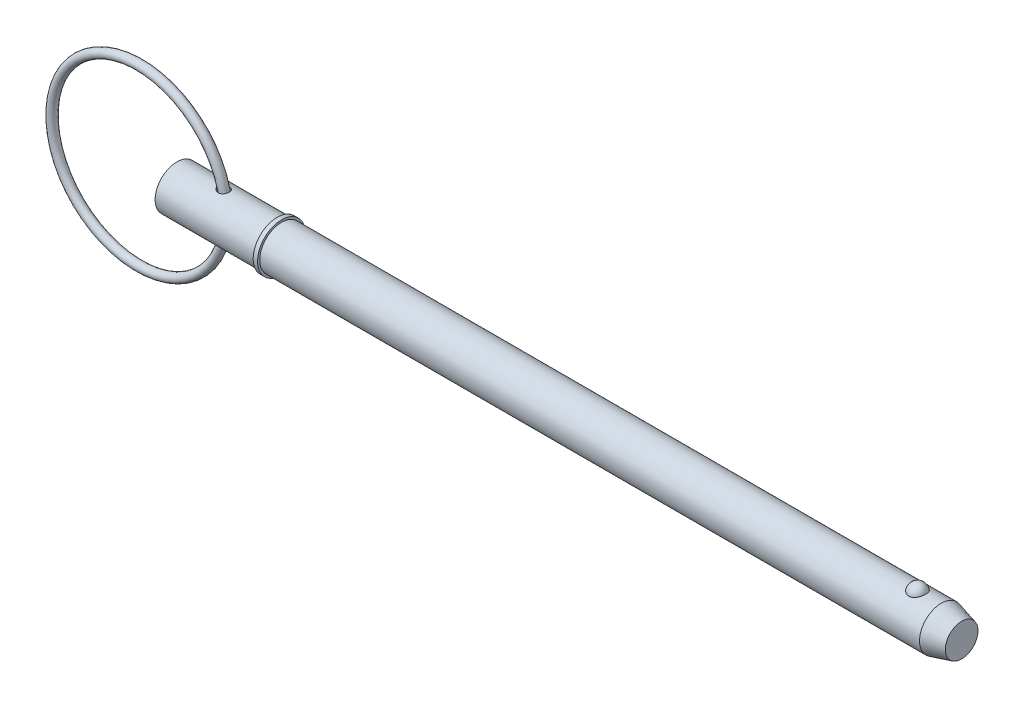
ISO-10303-21;
HEADER;
FILE_DESCRIPTION(('STEP AP214'),'2;1');
FILE_NAME('part.step','',(''),(''),'','','');
FILE_SCHEMA(('AUTOMOTIVE_DESIGN { 1 0 10303 214 1 1 1 1 }'));
ENDSEC;
DATA;
#1=APPLICATION_CONTEXT('core data for automotive mechanical design processes');
#2=APPLICATION_PROTOCOL_DEFINITION('international standard','automotive_design',2000,#1);
#3=PRODUCT_CONTEXT('',#1,'mechanical');
#4=PRODUCT('Part','Part','',(#3));
#5=PRODUCT_RELATED_PRODUCT_CATEGORY('part','',(#4));
#6=PRODUCT_DEFINITION_FORMATION('','',#4);
#7=PRODUCT_DEFINITION_CONTEXT('part definition',#1,'design');
#8=PRODUCT_DEFINITION('design','',#6,#7);
#9=PRODUCT_DEFINITION_SHAPE('','',#8);
#10=(LENGTH_UNIT() NAMED_UNIT(*) SI_UNIT(.MILLI.,.METRE.));
#11=(NAMED_UNIT(*) PLANE_ANGLE_UNIT() SI_UNIT($,.RADIAN.));
#12=(NAMED_UNIT(*) SI_UNIT($,.STERADIAN.) SOLID_ANGLE_UNIT());
#13=UNCERTAINTY_MEASURE_WITH_UNIT(LENGTH_MEASURE(1.E-05),#10,'distance_accuracy_value','');
#14=(GEOMETRIC_REPRESENTATION_CONTEXT(3) GLOBAL_UNCERTAINTY_ASSIGNED_CONTEXT((#13)) GLOBAL_UNIT_ASSIGNED_CONTEXT((#10,
#11,#12)) REPRESENTATION_CONTEXT('',''));
#15=CARTESIAN_POINT('',(0.,0.,0.));
#16=DIRECTION('',(0.,0.,1.));
#17=DIRECTION('',(1.,0.,0.));
#18=AXIS2_PLACEMENT_3D('',#15,#16,#17);
#19=CARTESIAN_POINT('',(-6.86864682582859,0.,0.));
#20=DIRECTION('',(0.,0.,1.));
#21=DIRECTION('',(1.,0.,0.));
#22=AXIS2_PLACEMENT_3D('',#19,#20,#21);
#23=TOROIDAL_SURFACE('',#22,15.875,0.794);
#24=CARTESIAN_POINT('',(9.80035317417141,0.,0.));
#25=VERTEX_POINT('',#24);
#26=VERTEX_LOOP('',#25);
#27=FACE_BOUND('',#26,.T.);
#28=ADVANCED_FACE('P0_F12',(#27),#23,.T.);
#29=CLOSED_SHELL('',(#28));
#30=MANIFOLD_SOLID_BREP('P0_B1',#29);
#31=CARTESIAN_POINT('',(0.,0.,0.));
#32=DIRECTION('',(1.,0.,0.));
#33=DIRECTION('',(0.,0.,-1.));
#34=AXIS2_PLACEMENT_3D('',#31,#32,#33);
#35=CYLINDRICAL_SURFACE('',#34,3.97);
#36=CARTESIAN_POINT('',(7.55504033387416,3.95240335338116,-0.373373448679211));
#37=CARTESIAN_POINT('',(7.57857626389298,3.94742764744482,-0.426034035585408));
#38=CARTESIAN_POINT('',(7.60690043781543,3.94158882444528,-0.476521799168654));
#39=CARTESIAN_POINT('',(7.67175252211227,3.92889627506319,-0.571840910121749));
#40=CARTESIAN_POINT('',(7.70829717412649,3.92204048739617,-0.616660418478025));
#41=CARTESIAN_POINT('',(7.7880127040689,3.90811378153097,-0.699502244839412));
#42=CARTESIAN_POINT('',(7.83115323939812,3.90104396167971,-0.737554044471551));
#43=CARTESIAN_POINT('',(7.92290500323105,3.88739302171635,-0.806417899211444));
#44=CARTESIAN_POINT('',(7.97151503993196,3.88081179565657,-0.837231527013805));
#45=CARTESIAN_POINT('',(8.07649084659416,3.86840671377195,-0.89285990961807));
#46=CARTESIAN_POINT('',(8.13315921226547,3.86266475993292,-0.917124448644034));
#47=CARTESIAN_POINT('',(8.249903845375,3.85323449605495,-0.95597423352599));
#48=CARTESIAN_POINT('',(8.30998046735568,3.84954640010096,-0.970558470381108));
#49=CARTESIAN_POINT('',(8.43159099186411,3.84477321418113,-0.989300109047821));
#50=CARTESIAN_POINT('',(8.49311729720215,3.84367671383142,-0.993503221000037));
#51=CARTESIAN_POINT('',(8.61594280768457,3.84429915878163,-0.991094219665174));
#52=CARTESIAN_POINT('',(8.67724211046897,3.84601670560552,-0.984487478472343));
#53=CARTESIAN_POINT('',(8.79355089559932,3.85191689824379,-0.961127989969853));
#54=CARTESIAN_POINT('',(8.84870898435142,3.85593011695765,-0.945070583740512));
#55=CARTESIAN_POINT('',(8.95525145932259,3.86583609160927,-0.903692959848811));
#56=CARTESIAN_POINT('',(9.00663668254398,3.87172842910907,-0.878374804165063));
#57=CARTESIAN_POINT('',(9.101933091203,3.88440641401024,-0.820440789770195));
#58=CARTESIAN_POINT('',(9.14607052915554,3.89114280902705,-0.788185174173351));
#59=CARTESIAN_POINT('',(9.22823149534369,3.90493885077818,-0.71671042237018));
#60=CARTESIAN_POINT('',(9.26625504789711,3.91199849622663,-0.677491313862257));
#61=CARTESIAN_POINT('',(9.33526828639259,3.92567450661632,-0.59313132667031));
#62=CARTESIAN_POINT('',(9.36624800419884,3.93229023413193,-0.547982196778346));
#63=CARTESIAN_POINT('',(9.42036305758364,3.94435299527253,-0.453062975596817));
#64=CARTESIAN_POINT('',(9.44349799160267,3.94979996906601,-0.403292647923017));
#65=CARTESIAN_POINT('',(9.48161154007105,3.95900091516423,-0.299892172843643));
#66=CARTESIAN_POINT('',(9.49648966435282,3.96273393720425,-0.246223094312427));
#67=CARTESIAN_POINT('',(9.51731386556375,3.96800895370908,-0.137074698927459));
#68=CARTESIAN_POINT('',(9.52325977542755,3.9695509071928,-0.0815953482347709));
#69=CARTESIAN_POINT('',(9.52608552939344,3.97028010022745,0.0297918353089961));
#70=CARTESIAN_POINT('',(9.52293563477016,3.96945961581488,0.0857004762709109));
#71=CARTESIAN_POINT('',(9.5075790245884,3.96553529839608,0.196178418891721));
#72=CARTESIAN_POINT('',(9.49537214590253,3.96243142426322,0.25074769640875));
#73=CARTESIAN_POINT('',(9.46218733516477,3.95427513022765,0.357000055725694));
#74=CARTESIAN_POINT('',(9.44120904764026,3.94922263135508,0.40868302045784));
#75=CARTESIAN_POINT('',(9.39097869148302,3.93771960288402,0.507691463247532));
#76=CARTESIAN_POINT('',(9.36172655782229,3.93126906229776,0.555016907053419));
#77=CARTESIAN_POINT('',(9.29572260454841,3.9176964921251,0.643874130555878));
#78=CARTESIAN_POINT('',(9.25898413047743,3.91057566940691,0.685416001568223));
#79=CARTESIAN_POINT('',(9.1789232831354,3.89645576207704,0.761601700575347));
#80=CARTESIAN_POINT('',(9.13560164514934,3.88945666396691,0.79624629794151));
#81=CARTESIAN_POINT('',(9.04406003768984,3.87645097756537,0.857319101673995));
#82=CARTESIAN_POINT('',(8.99589768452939,3.87043453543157,0.883831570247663));
#83=CARTESIAN_POINT('',(8.89567287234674,3.85997577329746,0.928447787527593));
#84=CARTESIAN_POINT('',(8.84361081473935,3.85553329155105,0.946552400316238));
#85=CARTESIAN_POINT('',(8.73746664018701,3.84871527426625,0.973904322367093));
#86=CARTESIAN_POINT('',(8.68340054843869,3.84632597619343,0.983210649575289));
#87=CARTESIAN_POINT('',(8.57443237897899,3.84376823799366,0.993162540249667));
#88=CARTESIAN_POINT('',(8.51953018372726,3.84360011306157,0.993806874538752));
#89=CARTESIAN_POINT('',(8.40868901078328,3.84546046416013,0.986583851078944));
#90=CARTESIAN_POINT('',(8.35276804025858,3.84755469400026,0.97846170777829));
#91=CARTESIAN_POINT('',(8.24293801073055,3.85374731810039,0.953777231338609));
#92=CARTESIAN_POINT('',(8.18902962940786,3.85784638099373,0.937212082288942));
#93=CARTESIAN_POINT('',(8.08103474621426,3.86789936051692,0.894850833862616));
#94=CARTESIAN_POINT('',(8.02716623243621,3.87395687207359,0.868522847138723));
#95=CARTESIAN_POINT('',(7.92444974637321,3.88711632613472,0.807586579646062));
#96=CARTESIAN_POINT('',(7.87560399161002,3.89421872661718,0.7729746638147));
#97=CARTESIAN_POINT('',(7.7825771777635,3.90895350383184,0.694712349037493));
#98=CARTESIAN_POINT('',(7.73864194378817,3.916595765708,0.650769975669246));
#99=CARTESIAN_POINT('',(7.65930793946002,3.93121788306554,0.555638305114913));
#100=CARTESIAN_POINT('',(7.62390591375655,3.93819799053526,0.504451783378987));
#101=CARTESIAN_POINT('',(7.56512704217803,3.95020492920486,0.399268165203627));
#102=CARTESIAN_POINT('',(7.54117152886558,3.95532161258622,0.345606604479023));
#103=CARTESIAN_POINT('',(7.5037545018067,3.96345177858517,0.234589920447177));
#104=CARTESIAN_POINT('',(7.49028363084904,3.96646713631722,0.177238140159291));
#105=CARTESIAN_POINT('',(7.4756155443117,3.96976030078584,0.0675802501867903));
#106=CARTESIAN_POINT('',(7.47319553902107,3.97031070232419,0.0154431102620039));
#107=CARTESIAN_POINT('',(7.47743162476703,3.96935406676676,-0.0884045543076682));
#108=CARTESIAN_POINT('',(7.48407724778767,3.96784940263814,-0.14011550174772));
#109=CARTESIAN_POINT('',(7.50184406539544,3.96390208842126,-0.222210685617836));
#110=CARTESIAN_POINT('',(7.51030342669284,3.96203347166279,-0.253229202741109));
#111=CARTESIAN_POINT('',(7.53036279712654,3.95766645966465,-0.314179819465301));
#112=CARTESIAN_POINT('',(7.5419623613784,3.9551681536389,-0.344112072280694));
#113=CARTESIAN_POINT('',(7.55504033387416,3.95240335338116,-0.373373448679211));
#114=B_SPLINE_CURVE_WITH_KNOTS('',3,(#36,#37,#38,#39,#40,#41,#42,#43,#44,#45,#46,#47,#48,#49,
#50,#51,#52,#53,#54,#55,#56,#57,#58,#59,#60,#61,#62,#63,#64,#65,#66,#67,#68,#69,#70,#71,#72,#73,
#74,#75,#76,#77,#78,#79,#80,#81,#82,#83,#84,#85,#86,#87,#88,#89,#90,#91,#92,#93,#94,#95,#96,#97,
#98,#99,#100,#101,#102,#103,#104,#105,#106,#107,#108,#109,#110,#111,#112,#113),.UNSPECIFIED.,
.T.,.F.,(4,2,2,2,2,2,2,2,2,2,2,2,2,2,2,2,2,2,2,2,2,2,2,2,2,2,2,2,2,2,2,2,2,2,2,2,2,2,4),(0.,
0.173554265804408,0.347465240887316,0.520599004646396,0.693695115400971,0.878558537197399,
1.0634412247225,1.24750837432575,1.43148407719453,1.60336872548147,1.77521512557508,
1.93967886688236,2.10414195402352,2.26883635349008,2.43353918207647,2.60020488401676,
2.76687370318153,2.93408806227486,3.10130543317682,3.26852958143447,3.43575504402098,
3.60268496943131,3.76959626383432,3.93471461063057,4.0998159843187,4.26380184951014,
4.42781098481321,4.5967184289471,4.76568224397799,4.94567321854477,5.12574332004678,
5.31261375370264,5.49941278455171,5.67537040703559,5.85117081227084,6.00695555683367,
6.16256057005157,6.25901137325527,6.35544851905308),.UNSPECIFIED.);
#115=CARTESIAN_POINT('',(7.55504033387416,3.95240335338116,-0.373373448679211));
#116=VERTEX_POINT('',#115);
#117=EDGE_CURVE('P1_E42',#116,#116,#114,.T.);
#118=ORIENTED_EDGE('',*,*,#117,.T.);
#119=EDGE_LOOP('',(#118));
#120=FACE_BOUND('',#119,.T.);
#121=CARTESIAN_POINT('',(0.,0.,0.));
#122=DIRECTION('',(1.,0.,0.));
#123=DIRECTION('',(0.,0.,-1.));
#124=AXIS2_PLACEMENT_3D('',#121,#122,#123);
#125=CIRCLE('',#124,3.97);
#126=CARTESIAN_POINT('',(0.,0.,-3.97));
#127=VERTEX_POINT('',#126);
#128=EDGE_CURVE('P1_E9',#127,#127,#125,.T.);
#129=ORIENTED_EDGE('',*,*,#128,.T.);
#130=EDGE_LOOP('',(#129));
#131=FACE_BOUND('',#130,.T.);
#132=CARTESIAN_POINT('',(18.256,0.,0.));
#133=DIRECTION('',(1.,0.,0.));
#134=DIRECTION('',(0.,0.,-1.));
#135=AXIS2_PLACEMENT_3D('',#132,#133,#134);
#136=CIRCLE('',#135,3.97);
#137=CARTESIAN_POINT('',(18.256,0.,-3.97));
#138=VERTEX_POINT('',#137);
#139=EDGE_CURVE('P1_E25',#138,#138,#136,.T.);
#140=ORIENTED_EDGE('',*,*,#139,.F.);
#141=EDGE_LOOP('',(#140));
#142=FACE_BOUND('',#141,.T.);
#143=CARTESIAN_POINT('',(7.55504033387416,-3.95240335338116,-0.373373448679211));
#144=CARTESIAN_POINT('',(7.53460920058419,-3.95672239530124,-0.327655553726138));
#145=CARTESIAN_POINT('',(7.51777420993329,-3.96039298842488,-0.280271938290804));
#146=CARTESIAN_POINT('',(7.49205527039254,-3.96606288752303,-0.183298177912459));
#147=CARTESIAN_POINT('',(7.48316724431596,-3.96806305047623,-0.133709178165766));
#148=CARTESIAN_POINT('',(7.47379315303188,-3.9701737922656,-0.0336103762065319));
#149=CARTESIAN_POINT('',(7.47332172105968,-3.97028108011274,0.0169008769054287));
#150=CARTESIAN_POINT('',(7.48084392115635,-3.96858544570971,0.11725681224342));
#151=CARTESIAN_POINT('',(7.48883849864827,-3.96678231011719,0.167101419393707));
#152=CARTESIAN_POINT('',(7.51265320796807,-3.96151492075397,0.263832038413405));
#153=CARTESIAN_POINT('',(7.52833209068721,-3.95808068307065,0.310754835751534));
#154=CARTESIAN_POINT('',(7.56673745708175,-3.94990960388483,0.401487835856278));
#155=CARTESIAN_POINT('',(7.58946563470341,-3.94517244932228,0.44529728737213));
#156=CARTESIAN_POINT('',(7.64284475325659,-3.93448395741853,0.53175081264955));
#157=CARTESIAN_POINT('',(7.67392233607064,-3.92847279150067,0.57412324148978));
#158=CARTESIAN_POINT('',(7.74208866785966,-3.91602761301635,0.653644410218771));
#159=CARTESIAN_POINT('',(7.77918016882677,-3.90959340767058,0.690790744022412));
#160=CARTESIAN_POINT('',(7.86273878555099,-3.89617013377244,0.763056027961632));
#161=CARTESIAN_POINT('',(7.90978795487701,-3.88919756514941,0.797506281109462));
#162=CARTESIAN_POINT('',(8.00882206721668,-3.87616232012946,0.858629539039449));
#163=CARTESIAN_POINT('',(8.06080923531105,-3.87010005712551,0.885299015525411));
#164=CARTESIAN_POINT('',(8.17187138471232,-3.85921766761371,0.931635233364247));
#165=CARTESIAN_POINT('',(8.23118658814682,-3.85449995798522,0.950754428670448));
#166=CARTESIAN_POINT('',(8.35233947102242,-3.84749758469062,0.97871022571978));
#167=CARTESIAN_POINT('',(8.41417663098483,-3.84521242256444,0.987548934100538));
#168=CARTESIAN_POINT('',(8.53665727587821,-3.84349493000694,0.994212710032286));
#169=CARTESIAN_POINT('',(8.59728174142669,-3.84397996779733,0.99235677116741));
#170=CARTESIAN_POINT('',(8.71718393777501,-3.84764343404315,0.978056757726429));
#171=CARTESIAN_POINT('',(8.77646227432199,-3.8508206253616,0.965617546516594));
#172=CARTESIAN_POINT('',(8.88778602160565,-3.85921632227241,0.931467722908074));
#173=CARTESIAN_POINT('',(8.94005016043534,-3.864284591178,0.91043061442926));
#174=CARTESIAN_POINT('',(9.04004360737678,-3.87587542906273,0.85974532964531));
#175=CARTESIAN_POINT('',(9.08777352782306,-3.88239780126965,0.830098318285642));
#176=CARTESIAN_POINT('',(9.17600506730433,-3.895934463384,0.763999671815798));
#177=CARTESIAN_POINT('',(9.21667512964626,-3.90292920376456,0.727768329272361));
#178=CARTESIAN_POINT('',(9.29136502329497,-3.91679963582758,0.648981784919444));
#179=CARTESIAN_POINT('',(9.32538470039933,-3.92367532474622,0.606426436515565));
#180=CARTESIAN_POINT('',(9.38618865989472,-3.9366168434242,0.515806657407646));
#181=CARTESIAN_POINT('',(9.4129117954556,-3.9426756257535,0.467700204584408));
#182=CARTESIAN_POINT('',(9.45812227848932,-3.95326415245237,0.367605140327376));
#183=CARTESIAN_POINT('',(9.47660924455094,-3.95779382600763,0.315616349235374));
#184=CARTESIAN_POINT('',(9.50505994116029,-3.96487773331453,0.208669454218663));
#185=CARTESIAN_POINT('',(9.51493710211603,-3.96741187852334,0.153686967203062));
#186=CARTESIAN_POINT('',(9.52562221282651,-3.97015680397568,0.0427905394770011));
#187=CARTESIAN_POINT('',(9.52643004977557,-3.97036755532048,-0.0131234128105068));
#188=CARTESIAN_POINT('',(9.51895215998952,-3.96844170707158,-0.124381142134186));
#189=CARTESIAN_POINT('',(9.51065320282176,-3.96630169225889,-0.179723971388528));
#190=CARTESIAN_POINT('',(9.48513477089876,-3.95989913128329,-0.288186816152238));
#191=CARTESIAN_POINT('',(9.46791509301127,-3.95563653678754,-0.341306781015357));
#192=CARTESIAN_POINT('',(9.42495956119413,-3.94545061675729,-0.443818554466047));
#193=CARTESIAN_POINT('',(9.39922309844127,-3.93952717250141,-0.493210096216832));
#194=CARTESIAN_POINT('',(9.33985370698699,-3.92667071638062,-0.586850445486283));
#195=CARTESIAN_POINT('',(9.30622091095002,-3.91973772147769,-0.631099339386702));
#196=CARTESIAN_POINT('',(9.23204774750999,-3.9056660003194,-0.713019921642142));
#197=CARTESIAN_POINT('',(9.19153441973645,-3.89852816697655,-0.750716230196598));
#198=CARTESIAN_POINT('',(9.10459278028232,-3.88483152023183,-0.818650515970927));
#199=CARTESIAN_POINT('',(9.05816529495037,-3.87827262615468,-0.848889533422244));
#200=CARTESIAN_POINT('',(8.96131655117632,-3.86655481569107,-0.900752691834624));
#201=CARTESIAN_POINT('',(8.91095192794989,-3.86137955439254,-0.922478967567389));
#202=CARTESIAN_POINT('',(8.8071927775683,-3.85288425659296,-0.957343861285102));
#203=CARTESIAN_POINT('',(8.75379837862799,-3.84956414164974,-0.97048284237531));
#204=CARTESIAN_POINT('',(8.64548182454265,-3.84510108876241,-0.988018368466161));
#205=CARTESIAN_POINT('',(8.59055875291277,-3.84395948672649,-0.992409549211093));
#206=CARTESIAN_POINT('',(8.48070473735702,-3.84391315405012,-0.992587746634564));
#207=CARTESIAN_POINT('',(8.42577379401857,-3.84500886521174,-0.988373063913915));
#208=CARTESIAN_POINT('',(8.31494327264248,-3.84934404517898,-0.971354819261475));
#209=CARTESIAN_POINT('',(8.25910274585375,-3.85267319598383,-0.958191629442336));
#210=CARTESIAN_POINT('',(8.15023512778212,-3.86114252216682,-0.923469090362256));
#211=CARTESIAN_POINT('',(8.09720922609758,-3.86628345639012,-0.901906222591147));
#212=CARTESIAN_POINT('',(7.9918189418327,-3.87819313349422,-0.849289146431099));
#213=CARTESIAN_POINT('',(7.93972943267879,-3.88504694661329,-0.817702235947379));
#214=CARTESIAN_POINT('',(7.84154327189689,-3.89937910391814,-0.746366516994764));
#215=CARTESIAN_POINT('',(7.79544783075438,-3.90685757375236,-0.706616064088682));
#216=CARTESIAN_POINT('',(7.71208259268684,-3.92134227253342,-0.621122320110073));
#217=CARTESIAN_POINT('',(7.67457985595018,-3.92835595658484,-0.57560820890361));
#218=CARTESIAN_POINT('',(7.60807883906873,-3.94134589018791,-0.478617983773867));
#219=CARTESIAN_POINT('',(7.57907194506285,-3.94732318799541,-0.427147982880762));
#220=CARTESIAN_POINT('',(7.55504033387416,-3.95240335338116,-0.373373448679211));
#221=B_SPLINE_CURVE_WITH_KNOTS('',3,(#143,#144,#145,#146,#147,#148,#149,#150,#151,#152,#153,
#154,#155,#156,#157,#158,#159,#160,#161,#162,#163,#164,#165,#166,#167,#168,#169,#170,#171,#172,
#173,#174,#175,#176,#177,#178,#179,#180,#181,#182,#183,#184,#185,#186,#187,#188,#189,#190,#191,
#192,#193,#194,#195,#196,#197,#198,#199,#200,#201,#202,#203,#204,#205,#206,#207,#208,#209,#210,
#211,#212,#213,#214,#215,#216,#217,#218,#219,#220),.UNSPECIFIED.,.T.,.F.,(4,2,2,2,2,2,2,2,2,2,2,
2,2,2,2,2,2,2,2,2,2,2,2,2,2,2,2,2,2,2,2,2,2,2,2,2,2,2,4),(0.,0.150601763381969,
0.301126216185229,0.451912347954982,0.602715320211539,0.750844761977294,0.899009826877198,
1.05703657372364,1.21513583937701,1.39056726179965,1.56607811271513,1.75265499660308,
1.93919364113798,2.12019769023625,2.30111860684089,2.46997605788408,2.63881067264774,
2.80278822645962,2.96676958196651,3.13208567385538,3.29740942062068,3.46437689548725,
3.63134644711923,3.79855889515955,3.96577515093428,4.13300336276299,4.30022876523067,
4.46681158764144,4.63337115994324,4.79786624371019,4.96235437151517,5.12694333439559,
5.29156480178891,5.46322695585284,5.63496109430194,5.81803489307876,6.00114560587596,
6.1784675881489,6.35560915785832),.UNSPECIFIED.);
#222=CARTESIAN_POINT('',(7.55504033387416,-3.95240335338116,-0.373373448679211));
#223=VERTEX_POINT('',#222);
#224=EDGE_CURVE('P1_E17',#223,#223,#221,.T.);
#225=ORIENTED_EDGE('',*,*,#224,.T.);
#226=EDGE_LOOP('',(#225));
#227=FACE_BOUND('',#226,.T.);
#228=ADVANCED_FACE('P1_F13',(#120,#131,#142,#227),#35,.T.);
#229=CARTESIAN_POINT('',(0.,0.,0.));
#230=DIRECTION('',(1.,0.,0.));
#231=DIRECTION('',(0.,0.,-1.));
#232=AXIS2_PLACEMENT_3D('',#229,#230,#231);
#233=CYLINDRICAL_SURFACE('',#232,3.97);
#234=CARTESIAN_POINT('',(139.175939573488,0.,0.));
#235=DIRECTION('',(1.,0.,0.));
#236=DIRECTION('',(0.,0.,-1.));
#237=AXIS2_PLACEMENT_3D('',#234,#235,#236);
#238=CIRCLE('',#237,3.97);
#239=CARTESIAN_POINT('',(139.175939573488,0.,-3.97));
#240=VERTEX_POINT('',#239);
#241=EDGE_CURVE('P1_E99',#240,#240,#238,.T.);
#242=ORIENTED_EDGE('',*,*,#241,.F.);
#243=EDGE_LOOP('',(#242));
#244=FACE_BOUND('',#243,.T.);
#245=CARTESIAN_POINT('',(19.05,0.,0.));
#246=DIRECTION('',(1.,0.,0.));
#247=DIRECTION('',(0.,0.,-1.));
#248=AXIS2_PLACEMENT_3D('',#245,#246,#247);
#249=CIRCLE('',#248,3.97);
#250=CARTESIAN_POINT('',(19.05,0.,-3.97));
#251=VERTEX_POINT('',#250);
#252=EDGE_CURVE('P1_E96',#251,#251,#249,.T.);
#253=ORIENTED_EDGE('',*,*,#252,.T.);
#254=EDGE_LOOP('',(#253));
#255=FACE_BOUND('',#254,.T.);
#256=CARTESIAN_POINT('',(134.845192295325,3.65715365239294,1.54470941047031));
#257=CARTESIAN_POINT('',(134.765244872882,3.65716001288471,1.54470290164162));
#258=CARTESIAN_POINT('',(134.685165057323,3.65987074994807,1.5383254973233));
#259=CARTESIAN_POINT('',(134.527237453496,3.67042218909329,1.51297018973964));
#260=CARTESIAN_POINT('',(134.44939614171,3.67827646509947,1.4939589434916));
#261=CARTESIAN_POINT('',(134.298461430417,3.69818848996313,1.44395950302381));
#262=CARTESIAN_POINT('',(134.225356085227,3.71023513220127,1.41300293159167));
#263=CARTESIAN_POINT('',(134.085563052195,3.73721833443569,1.34000212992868));
#264=CARTESIAN_POINT('',(134.018872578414,3.75215363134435,1.29796274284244));
#265=CARTESIAN_POINT('',(133.89148864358,3.78384968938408,1.20248834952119));
#266=CARTESIAN_POINT('',(133.831029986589,3.800651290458,1.14875388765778));
#267=CARTESIAN_POINT('',(133.719694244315,3.83398532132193,1.03205417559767));
#268=CARTESIAN_POINT('',(133.668820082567,3.85051766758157,0.969086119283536));
#269=CARTESIAN_POINT('',(133.575632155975,3.88238608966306,0.832526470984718));
#270=CARTESIAN_POINT('',(133.533796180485,3.89763698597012,0.758588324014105));
#271=CARTESIAN_POINT('',(133.462510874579,3.92451063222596,0.604352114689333));
#272=CARTESIAN_POINT('',(133.433062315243,3.93613315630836,0.524053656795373));
#273=CARTESIAN_POINT('',(133.386892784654,3.95467606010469,0.358403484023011));
#274=CARTESIAN_POINT('',(133.370312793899,3.96154426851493,0.273006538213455));
#275=CARTESIAN_POINT('',(133.350756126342,3.96967008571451,0.100408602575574));
#276=CARTESIAN_POINT('',(133.347778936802,3.97092790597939,0.0132076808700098));
#277=CARTESIAN_POINT('',(133.355458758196,3.96771794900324,-0.159844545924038));
#278=CARTESIAN_POINT('',(133.366016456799,3.96329187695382,-0.245701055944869));
#279=CARTESIAN_POINT('',(133.40038009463,3.94923163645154,-0.414277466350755));
#280=CARTESIAN_POINT('',(133.424186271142,3.93959737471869,-0.496997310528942));
#281=CARTESIAN_POINT('',(133.48461142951,3.91607752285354,-0.657113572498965));
#282=CARTESIAN_POINT('',(133.521249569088,3.90218558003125,-0.734501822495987));
#283=CARTESIAN_POINT('',(133.606593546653,3.87158287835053,-0.881704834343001));
#284=CARTESIAN_POINT('',(133.655300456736,3.85487186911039,-0.951518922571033));
#285=CARTESIAN_POINT('',(133.764116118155,3.82028735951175,-1.08208159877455));
#286=CARTESIAN_POINT('',(133.824295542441,3.80240713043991,-1.14276958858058));
#287=CARTESIAN_POINT('',(133.954493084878,3.76758161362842,-1.25282437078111));
#288=CARTESIAN_POINT('',(134.024510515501,3.75063626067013,-1.30219195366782));
#289=CARTESIAN_POINT('',(134.17118160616,3.71998948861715,-1.38729709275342));
#290=CARTESIAN_POINT('',(134.247681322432,3.70623183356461,-1.42327904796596));
#291=CARTESIAN_POINT('',(134.406298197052,3.68323188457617,-1.48178996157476));
#292=CARTESIAN_POINT('',(134.4884132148,3.67398788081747,-1.50432401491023));
#293=CARTESIAN_POINT('',(134.651481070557,3.66152163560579,-1.53440939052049));
#294=CARTESIAN_POINT('',(134.732284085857,3.65801951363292,-1.54265826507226));
#295=CARTESIAN_POINT('',(134.89420850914,3.65657341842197,-1.54608423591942));
#296=CARTESIAN_POINT('',(134.975329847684,3.65862829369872,-1.54126404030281));
#297=CARTESIAN_POINT('',(135.132812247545,3.66788969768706,-1.5190847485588));
#298=CARTESIAN_POINT('',(135.209242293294,3.67492621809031,-1.50213925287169));
#299=CARTESIAN_POINT('',(135.358041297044,3.69318404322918,-1.45666982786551));
#300=CARTESIAN_POINT('',(135.430409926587,3.7044056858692,-1.42814496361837));
#301=CARTESIAN_POINT('',(135.570802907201,3.73012749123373,-1.35956319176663));
#302=CARTESIAN_POINT('',(135.638700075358,3.74469307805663,-1.31927107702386));
#303=CARTESIAN_POINT('',(135.766864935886,3.77545272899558,-1.22847440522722));
#304=CARTESIAN_POINT('',(135.827130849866,3.79164717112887,-1.17796747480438));
#305=CARTESIAN_POINT('',(135.941634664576,3.82490325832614,-1.0651926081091));
#306=CARTESIAN_POINT('',(135.995413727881,3.84196735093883,-1.00245914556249));
#307=CARTESIAN_POINT('',(136.092098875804,3.87439863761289,-0.868715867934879));
#308=CARTESIAN_POINT('',(136.135003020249,3.88976552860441,-0.797704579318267));
#309=CARTESIAN_POINT('',(136.210266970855,3.91771381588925,-0.646896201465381));
#310=CARTESIAN_POINT('',(136.24225322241,3.93019255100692,-0.566893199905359));
#311=CARTESIAN_POINT('',(136.293110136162,3.95043886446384,-0.402255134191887));
#312=CARTESIAN_POINT('',(136.311980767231,3.95820643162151,-0.31762005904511));
#313=CARTESIAN_POINT('',(136.33621625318,3.96823733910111,-0.146156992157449));
#314=CARTESIAN_POINT('',(136.341587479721,3.970503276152,-0.0593300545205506));
#315=CARTESIAN_POINT('',(136.338730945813,3.96930811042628,0.114057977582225));
#316=CARTESIAN_POINT('',(136.330503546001,3.9658471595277,0.200619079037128));
#317=CARTESIAN_POINT('',(136.300706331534,3.95358562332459,0.3705066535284));
#318=CARTESIAN_POINT('',(136.27921294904,3.94481563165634,0.453848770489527));
#319=CARTESIAN_POINT('',(136.22338397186,3.92284586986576,0.615497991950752));
#320=CARTESIAN_POINT('',(136.189047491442,3.90964579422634,0.693804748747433));
#321=CARTESIAN_POINT('',(136.107970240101,3.88006987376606,0.8437030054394));
#322=CARTESIAN_POINT('',(136.061153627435,3.86367478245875,0.915249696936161));
#323=CARTESIAN_POINT('',(135.956189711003,3.82949741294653,1.04910810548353));
#324=CARTESIAN_POINT('',(135.898042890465,3.81171519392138,1.11142021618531));
#325=CARTESIAN_POINT('',(135.771743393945,3.7767336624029,1.22503948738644));
#326=CARTESIAN_POINT('',(135.703597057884,3.75953398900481,1.27635357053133));
#327=CARTESIAN_POINT('',(135.558900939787,3.72770506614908,1.36653336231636));
#328=CARTESIAN_POINT('',(135.482348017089,3.7130767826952,1.40539439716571));
#329=CARTESIAN_POINT('',(135.325759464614,3.68864287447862,1.4683048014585));
#330=CARTESIAN_POINT('',(135.245930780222,3.67869017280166,1.49281289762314));
#331=CARTESIAN_POINT('',(135.082987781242,3.66414535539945,1.52817474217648));
#332=CARTESIAN_POINT('',(134.999884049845,3.65953723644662,1.53906926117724));
#333=CARTESIAN_POINT('',(134.892776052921,3.65738948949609,1.54414878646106));
#334=CARTESIAN_POINT('',(134.868990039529,3.65715175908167,1.54471134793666));
#335=CARTESIAN_POINT('',(134.845192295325,3.65715365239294,1.54470941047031));
#336=B_SPLINE_CURVE_WITH_KNOTS('',3,(#256,#257,#258,#259,#260,#261,#262,#263,#264,#265,#266,
#267,#268,#269,#270,#271,#272,#273,#274,#275,#276,#277,#278,#279,#280,#281,#282,#283,#284,#285,
#286,#287,#288,#289,#290,#291,#292,#293,#294,#295,#296,#297,#298,#299,#300,#301,#302,#303,#304,
#305,#306,#307,#308,#309,#310,#311,#312,#313,#314,#315,#316,#317,#318,#319,#320,#321,#322,#323,
#324,#325,#326,#327,#328,#329,#330,#331,#332,#333,#334,#335),.UNSPECIFIED.,.T.,.F.,(4,2,2,2,2,2,
2,2,2,2,2,2,2,2,2,2,2,2,2,2,2,2,2,2,2,2,2,2,2,2,2,2,2,2,2,2,2,2,2,4),(0.,0.239777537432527,
0.48019041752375,0.719971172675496,0.959647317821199,1.20639040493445,1.45320863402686,
1.71093679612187,1.96868099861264,2.22921052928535,2.48973023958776,2.74834928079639,
3.0069729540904,3.2659844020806,3.5250188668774,3.78570385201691,4.0463706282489,
4.30201257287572,4.55755760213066,4.80022994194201,5.04285200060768,5.27757006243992,
5.5123070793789,5.75210128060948,5.9919512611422,6.24392810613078,6.49594987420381,
6.75588818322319,7.01582710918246,7.27564332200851,7.53545264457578,7.79377886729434,
8.05212290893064,8.31207418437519,8.57201437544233,8.83179046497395,9.09166393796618,
9.34270057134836,9.59298357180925,9.66435753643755),.UNSPECIFIED.);
#337=CARTESIAN_POINT('',(134.845192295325,3.65715365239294,1.54470941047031));
#338=VERTEX_POINT('',#337);
#339=EDGE_CURVE('P1_E34',#338,#338,#336,.T.);
#340=ORIENTED_EDGE('',*,*,#339,.T.);
#341=EDGE_LOOP('',(#340));
#342=FACE_BOUND('',#341,.T.);
#343=ADVANCED_FACE('P1_F46',(#244,#255,#342),#233,.T.);
#344=CARTESIAN_POINT('',(0.,0.,0.));
#345=DIRECTION('',(-1.,0.,0.));
#346=DIRECTION('',(0.,0.,1.));
#347=AXIS2_PLACEMENT_3D('',#344,#345,#346);
#348=PLANE('',#347);
#349=ORIENTED_EDGE('',*,*,#128,.F.);
#350=EDGE_LOOP('',(#349));
#351=FACE_BOUND('',#350,.T.);
#352=ADVANCED_FACE('P1_F15',(#351),#348,.T.);
#353=CARTESIAN_POINT('',(18.256,3.97,0.));
#354=DIRECTION('',(-1.,0.,0.));
#355=DIRECTION('',(0.,0.,1.));
#356=AXIS2_PLACEMENT_3D('',#353,#354,#355);
#357=PLANE('',#356);
#358=ORIENTED_EDGE('',*,*,#139,.T.);
#359=EDGE_LOOP('',(#358));
#360=FACE_BOUND('',#359,.T.);
#361=CARTESIAN_POINT('',(18.256,0.,0.));
#362=DIRECTION('',(1.,0.,0.));
#363=DIRECTION('',(0.,0.,-1.));
#364=AXIS2_PLACEMENT_3D('',#361,#362,#363);
#365=CIRCLE('',#364,4.367);
#366=CARTESIAN_POINT('',(18.256,0.,-4.367));
#367=VERTEX_POINT('',#366);
#368=EDGE_CURVE('P1_E30',#367,#367,#365,.T.);
#369=ORIENTED_EDGE('',*,*,#368,.F.);
#370=EDGE_LOOP('',(#369));
#371=FACE_BOUND('',#370,.T.);
#372=ADVANCED_FACE('P1_F81',(#360,#371),#357,.T.);
#373=CARTESIAN_POINT('',(0.,0.,0.));
#374=DIRECTION('',(1.,0.,0.));
#375=DIRECTION('',(0.,0.,-1.));
#376=AXIS2_PLACEMENT_3D('',#373,#374,#375);
#377=CYLINDRICAL_SURFACE('',#376,4.367);
#378=ORIENTED_EDGE('',*,*,#368,.T.);
#379=EDGE_LOOP('',(#378));
#380=FACE_BOUND('',#379,.T.);
#381=CARTESIAN_POINT('',(19.05,0.,0.));
#382=DIRECTION('',(1.,0.,0.));
#383=DIRECTION('',(0.,0.,-1.));
#384=AXIS2_PLACEMENT_3D('',#381,#382,#383);
#385=CIRCLE('',#384,4.367);
#386=CARTESIAN_POINT('',(19.05,0.,-4.367));
#387=VERTEX_POINT('',#386);
#388=EDGE_CURVE('P1_E95',#387,#387,#385,.T.);
#389=ORIENTED_EDGE('',*,*,#388,.F.);
#390=EDGE_LOOP('',(#389));
#391=FACE_BOUND('',#390,.T.);
#392=ADVANCED_FACE('P1_F68',(#380,#391),#377,.T.);
#393=CARTESIAN_POINT('',(19.05,4.367,0.));
#394=DIRECTION('',(1.,0.,0.));
#395=DIRECTION('',(0.,0.,-1.));
#396=AXIS2_PLACEMENT_3D('',#393,#394,#395);
#397=PLANE('',#396);
#398=ORIENTED_EDGE('',*,*,#388,.T.);
#399=EDGE_LOOP('',(#398));
#400=FACE_BOUND('',#399,.T.);
#401=ORIENTED_EDGE('',*,*,#252,.F.);
#402=EDGE_LOOP('',(#401));
#403=FACE_BOUND('',#402,.T.);
#404=ADVANCED_FACE('P1_F62',(#400,#403),#397,.T.);
#405=CARTESIAN_POINT('',(142.88,0.,0.));
#406=DIRECTION('',(-1.,0.,0.));
#407=DIRECTION('',(0.,0.,1.));
#408=AXIS2_PLACEMENT_3D('',#405,#406,#407);
#409=CONICAL_SURFACE('',#408,2.97750000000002,0.26179938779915);
#410=ORIENTED_EDGE('',*,*,#241,.T.);
#411=EDGE_LOOP('',(#410));
#412=FACE_BOUND('',#411,.T.);
#413=CARTESIAN_POINT('',(142.88,0.,0.));
#414=DIRECTION('',(1.,0.,0.));
#415=DIRECTION('',(0.,0.,-1.));
#416=AXIS2_PLACEMENT_3D('',#413,#414,#415);
#417=CIRCLE('',#416,2.97750000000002);
#418=CARTESIAN_POINT('',(142.88,0.,-2.97750000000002));
#419=VERTEX_POINT('',#418);
#420=EDGE_CURVE('P1_E41',#419,#419,#417,.T.);
#421=ORIENTED_EDGE('',*,*,#420,.F.);
#422=EDGE_LOOP('',(#421));
#423=FACE_BOUND('',#422,.T.);
#424=ADVANCED_FACE('P1_F59',(#412,#423),#409,.T.);
#425=CARTESIAN_POINT('',(142.88,2.97750000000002,0.));
#426=DIRECTION('',(1.,0.,0.));
#427=DIRECTION('',(0.,0.,-1.));
#428=AXIS2_PLACEMENT_3D('',#425,#426,#427);
#429=PLANE('',#428);
#430=ORIENTED_EDGE('',*,*,#420,.T.);
#431=EDGE_LOOP('',(#430));
#432=FACE_BOUND('',#431,.T.);
#433=ADVANCED_FACE('P1_F55',(#432),#429,.T.);
#434=CARTESIAN_POINT('',(134.845192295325,3.573,0.));
#435=DIRECTION('',(-1.,0.,0.));
#436=DIRECTION('',(0.,1.,0.));
#437=AXIS2_PLACEMENT_3D('',#434,#435,#436);
#438=SPHERICAL_SURFACE('',#437,1.54700000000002);
#439=ORIENTED_EDGE('',*,*,#339,.F.);
#440=EDGE_LOOP('',(#439));
#441=FACE_BOUND('',#440,.T.);
#442=ADVANCED_FACE('P1_F50',(#441),#438,.T.);
#443=CARTESIAN_POINT('',(-6.86864682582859,0.,0.));
#444=DIRECTION('',(0.,0.,1.));
#445=DIRECTION('',(1.,0.,0.));
#446=AXIS2_PLACEMENT_3D('',#443,#444,#445);
#447=TOROIDAL_SURFACE('',#446,15.875,0.9925);
#448=ORIENTED_EDGE('',*,*,#224,.F.);
#449=EDGE_LOOP('',(#448));
#450=FACE_BOUND('',#449,.T.);
#451=ORIENTED_EDGE('',*,*,#117,.F.);
#452=EDGE_LOOP('',(#451));
#453=FACE_BOUND('',#452,.T.);
#454=ADVANCED_FACE('P1_F54',(#450,#453),#447,.F.);
#455=CLOSED_SHELL('',(#228,#343,#352,#372,#392,#404,#424,#433,#442,#454));
#456=MANIFOLD_SOLID_BREP('P1_B1',#455);
#457=ADVANCED_BREP_SHAPE_REPRESENTATION('',(#18,#30,#456),#14);
#458=SHAPE_DEFINITION_REPRESENTATION(#9,#457);
ENDSEC;
END-ISO-10303-21;
